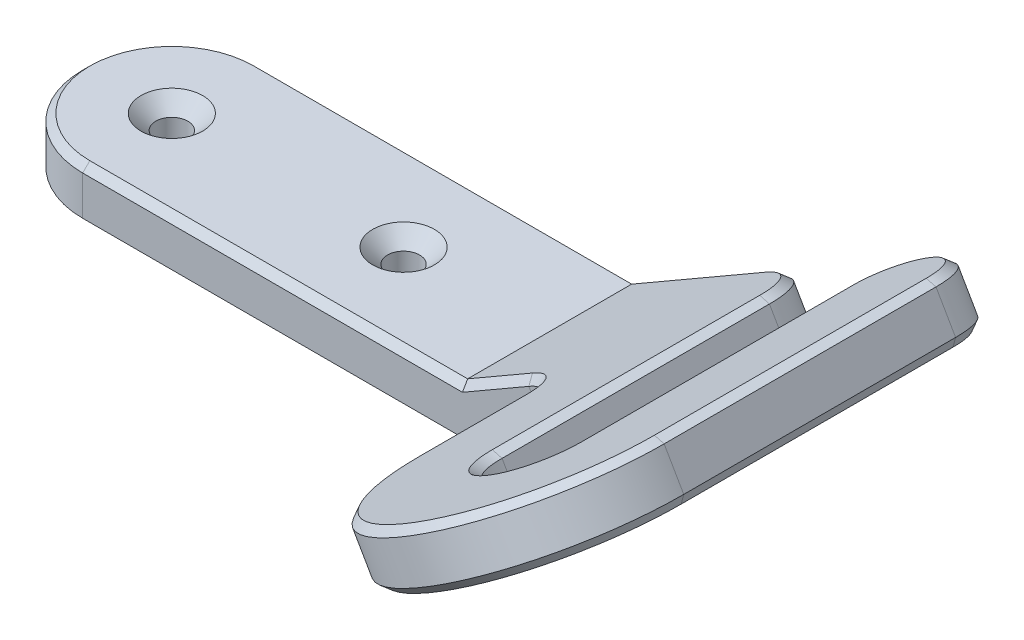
from build123d import *

# Parameters (mm, degrees)
EXTRUDE_THIN1_DEPTH                             = 25
FILLET1_RADIUS                                  = 25
FILLET1_LENGTH                                  = 15
EXTRUDE1_DEPTH                                  = 15
CSK_FOR_M8_FLAT_HEAD_MACHINE_SCREW1_D           = 9
CSK_FOR_M8_FLAT_HEAD_MACHINE_SCREW1_CSINK_D     = 17.3
CSK_FOR_M8_FLAT_HEAD_MACHINE_SCREW1_CSINK_ANGLE = 90
CHAMFER1_SIZE                                   = 2


with BuildPart() as part:
    # Sketch1 → Extrude-Thin1 (new, symmetric)
    with BuildSketch(Plane.XY):
        Polygon((21.650635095, 12.5), (0, 0), (-135, 0), (-135, 15), (-4.019237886, 15), (14.150635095, 25.490381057), align=None)
    extrude(amount=EXTRUDE_THIN1_DEPTH, both=True)

    # Fillet1: full round fillet: the end face becomes a half cylinder, R = half its width
    fillet1_face = Plane((-135, 7.5, 0), x_dir=(0, 1, 0), z_dir=(-1, 0, 0))  # on the end face: x along it, z out of the body
    fillet1_slab = fillet1_face.offset(-FILLET1_RADIUS / 2) * Box(FILLET1_LENGTH, 2 * FILLET1_RADIUS, FILLET1_RADIUS, mode=Mode.PRIVATE)  # the body's end, R deep
    fillet1_round = Plane((-110, 7.5, 0), x_dir=(-1, 0, 0), z_dir=(0, 1, 0)) * Cylinder(FILLET1_RADIUS, FILLET1_LENGTH, mode=Mode.PRIVATE)  # its axis R under the face
    add(fillet1_slab - fillet1_round, mode=Mode.SUBTRACT)

    # Sketch2 → Extrude1 (add)
    with BuildSketch(Plane(origin=(-7.5, 12.990381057, 0), x_dir=(-0.8660254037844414, -0.49999999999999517, 0), z_dir=(-0.49999999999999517, 0.8660254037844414, 0))):
        with BuildLine():
            Line((-25, -25), (-47.5, -25))
            ThreePointArc((-47.5, -25), (-58.106601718, -20.606601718), (-62.5, -10))
            Line((-62.5, -10), (-62.5, 65))
            ThreePointArc((-62.5, 65), (-75, 77.5), (-87.5, 65))
            Line((-87.5, 65), (-87.5, -11.25))
            ThreePointArc((-87.5, -11.25), (-101.25, -25), (-115, -11.25))
            Line((-115, -11.25), (-115, 65))
            ThreePointArc((-115, 65), (-75, 105), (-35, 65))
            Line((-35, 65), (-35, 35))
            ThreePointArc((-35, 35), (-32.071067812, 27.928932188), (-25, 25))
            Line((-25, 25), (-25, -25))
        make_face()
    extrude(amount=-EXTRUDE1_DEPTH)

    # CSK for M8 Flat Head Machine Screw1 (through all)
    with Locations(Plane(origin=(0, 15, 0), x_dir=(-1, 0, 0), z_dir=(0, 1, 0))):
        with Locations((45, 0), (110, 0)):
            CounterSinkHole(CSK_FOR_M8_FLAT_HEAD_MACHINE_SCREW1_D / 2, CSK_FOR_M8_FLAT_HEAD_MACHINE_SCREW1_CSINK_D / 2, counter_sink_angle=CSK_FOR_M8_FLAT_HEAD_MACHINE_SCREW1_CSINK_ANGLE)

    # Chamfer1
    chamfer1_edges = [part.edges().sort_by_distance(p)[0] for p in [
        (5.065698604, 20.245190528, 25),
        (-57.009618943, 15, 25),
        (-55, 0, 25),
        (-55, 0, -25),
        (-57.009618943, 15, -25),
        (-135, 15, 0),
        (-135, 0, 0),
        (20.274359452, 29.025914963, 27.928932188),
        (22.810889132, 30.490381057, 50),
        (57.451905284, 50.490381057, 105),
        (92.092921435, 70.490381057, 26.875),
        (80.185072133, 63.615381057, -25),
        (68.277222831, 56.740381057, 26.875),
        (57.451905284, 50.490381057, 77.5),
        (46.626587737, 44.240381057, 27.5),
        (42.821793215, 42.043681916, -20.606601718),
        (50.321793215, 29.053300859, -20.606601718),
        (54.126587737, 31.25, 27.5),
        (64.951905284, 37.5, 77.5),
        (75.777222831, 43.75, 26.875),
        (87.685072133, 50.625, -25),
        (99.592921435, 57.5, 26.875),
        (64.951905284, 37.5, 105),
        (30.310889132, 17.5, 50),
        (27.774359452, 16.035533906, 27.928932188),
        (10.825317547, 6.25, 25),
        (14.808484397, 25.870190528, -25),
        (20.56810334, 11.875, -25),
    ]]
    chamfer(chamfer1_edges, length=CHAMFER1_SIZE)


solid = part.part
